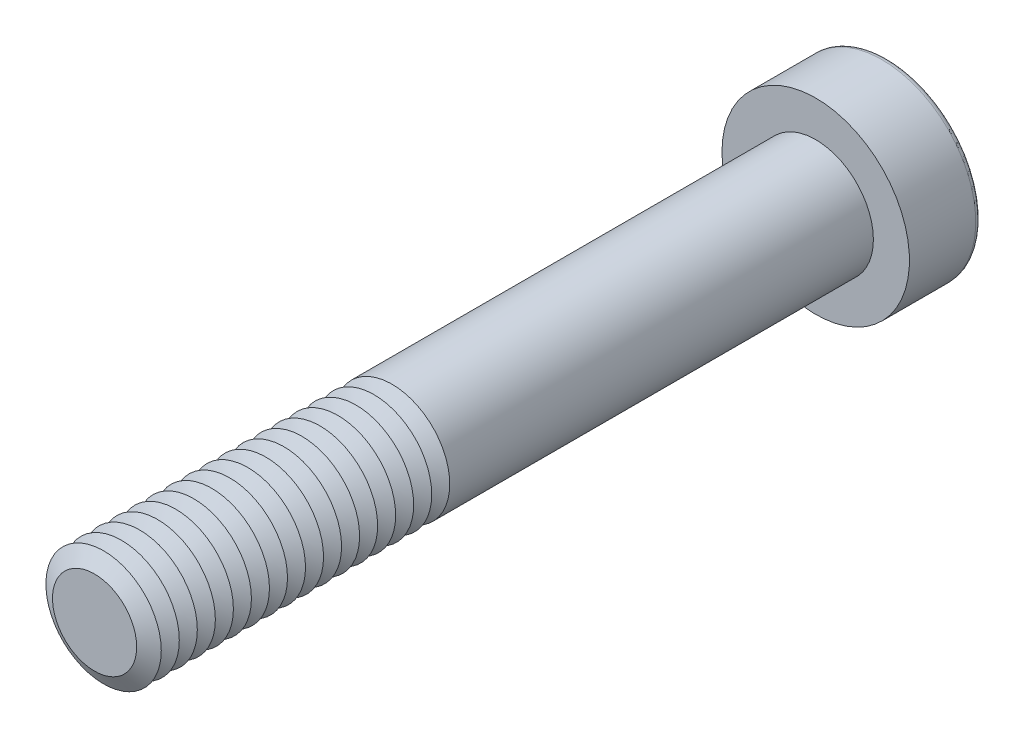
ISO-10303-21;
HEADER;
FILE_DESCRIPTION(('STEP AP214'),'2;1');
FILE_NAME('part.step','',(''),(''),'','','');
FILE_SCHEMA(('AUTOMOTIVE_DESIGN { 1 0 10303 214 1 1 1 1 }'));
ENDSEC;
DATA;
#1=APPLICATION_CONTEXT('core data for automotive mechanical design processes');
#2=APPLICATION_PROTOCOL_DEFINITION('international standard','automotive_design',2000,#1);
#3=PRODUCT_CONTEXT('',#1,'mechanical');
#4=PRODUCT('Part','Part','',(#3));
#5=PRODUCT_RELATED_PRODUCT_CATEGORY('part','',(#4));
#6=PRODUCT_DEFINITION_FORMATION('','',#4);
#7=PRODUCT_DEFINITION_CONTEXT('part definition',#1,'design');
#8=PRODUCT_DEFINITION('design','',#6,#7);
#9=PRODUCT_DEFINITION_SHAPE('','',#8);
#10=(LENGTH_UNIT() NAMED_UNIT(*) SI_UNIT(.MILLI.,.METRE.));
#11=(NAMED_UNIT(*) PLANE_ANGLE_UNIT() SI_UNIT($,.RADIAN.));
#12=(NAMED_UNIT(*) SI_UNIT($,.STERADIAN.) SOLID_ANGLE_UNIT());
#13=UNCERTAINTY_MEASURE_WITH_UNIT(LENGTH_MEASURE(1.E-05),#10,'distance_accuracy_value','');
#14=(GEOMETRIC_REPRESENTATION_CONTEXT(3) GLOBAL_UNCERTAINTY_ASSIGNED_CONTEXT((#13)) GLOBAL_UNIT_ASSIGNED_CONTEXT((#10,
#11,#12)) REPRESENTATION_CONTEXT('',''));
#15=CARTESIAN_POINT('',(0.,0.,0.));
#16=DIRECTION('',(0.,0.,1.));
#17=DIRECTION('',(1.,0.,0.));
#18=AXIS2_PLACEMENT_3D('',#15,#16,#17);
#19=CARTESIAN_POINT('',(0.,0.,45.625));
#20=DIRECTION('',(0.,0.,1.));
#21=DIRECTION('',(1.,0.,0.));
#22=AXIS2_PLACEMENT_3D('',#19,#20,#21);
#23=CONICAL_SURFACE('',#22,4.,1.0471975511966);
#24=CARTESIAN_POINT('',(0.,0.,45.));
#25=DIRECTION('',(0.,0.,1.));
#26=DIRECTION('',(1.,0.,0.));
#27=AXIS2_PLACEMENT_3D('',#24,#25,#26);
#28=CIRCLE('',#27,2.91746824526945);
#29=CARTESIAN_POINT('',(2.91746824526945,0.,45.));
#30=VERTEX_POINT('',#29);
#31=EDGE_CURVE('E313',#30,#30,#28,.T.);
#32=ORIENTED_EDGE('',*,*,#31,.T.);
#33=EDGE_LOOP('',(#32));
#34=FACE_BOUND('',#33,.T.);
#35=CARTESIAN_POINT('',(0.,0.,45.625));
#36=DIRECTION('',(0.,0.,1.));
#37=DIRECTION('',(1.,0.,0.));
#38=AXIS2_PLACEMENT_3D('',#35,#36,#37);
#39=CIRCLE('',#38,4.);
#40=CARTESIAN_POINT('',(4.,0.,45.625));
#41=VERTEX_POINT('',#40);
#42=EDGE_CURVE('E316',#41,#41,#39,.T.);
#43=ORIENTED_EDGE('',*,*,#42,.F.);
#44=EDGE_LOOP('',(#43));
#45=FACE_BOUND('',#44,.T.);
#46=ADVANCED_FACE('F39',(#34,#45),#23,.T.);
#47=CARTESIAN_POINT('',(0.,0.,45.));
#48=DIRECTION('',(0.,0.,-1.));
#49=DIRECTION('',(-1.,0.,0.));
#50=AXIS2_PLACEMENT_3D('',#47,#48,#49);
#51=CONICAL_SURFACE('',#50,2.91746824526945,1.0471975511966);
#52=CARTESIAN_POINT('',(0.,0.,44.375));
#53=DIRECTION('',(0.,0.,1.));
#54=DIRECTION('',(1.,0.,0.));
#55=AXIS2_PLACEMENT_3D('',#52,#53,#54);
#56=CIRCLE('',#55,4.);
#57=CARTESIAN_POINT('',(4.,0.,44.375));
#58=VERTEX_POINT('',#57);
#59=EDGE_CURVE('E323',#58,#58,#56,.T.);
#60=ORIENTED_EDGE('',*,*,#59,.T.);
#61=EDGE_LOOP('',(#60));
#62=FACE_BOUND('',#61,.T.);
#63=ORIENTED_EDGE('',*,*,#31,.F.);
#64=EDGE_LOOP('',(#63));
#65=FACE_BOUND('',#64,.T.);
#66=ADVANCED_FACE('F245',(#62,#65),#51,.T.);
#67=CARTESIAN_POINT('',(0.,0.,50.));
#68=DIRECTION('',(0.,0.,1.));
#69=DIRECTION('',(1.,0.,0.));
#70=AXIS2_PLACEMENT_3D('',#67,#68,#69);
#71=PLANE('',#70);
#72=CARTESIAN_POINT('',(0.,0.,50.));
#73=DIRECTION('',(0.,0.,1.));
#74=DIRECTION('',(1.,0.,0.));
#75=AXIS2_PLACEMENT_3D('',#72,#73,#74);
#76=CIRCLE('',#75,2.91746824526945);
#77=CARTESIAN_POINT('',(2.91746824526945,0.,50.));
#78=VERTEX_POINT('',#77);
#79=EDGE_CURVE('E174',#78,#78,#76,.T.);
#80=ORIENTED_EDGE('',*,*,#79,.T.);
#81=EDGE_LOOP('',(#80));
#82=FACE_BOUND('',#81,.T.);
#83=ADVANCED_FACE('F251',(#82),#71,.T.);
#84=CARTESIAN_POINT('',(0.,0.,50.));
#85=DIRECTION('',(0.,0.,-1.));
#86=DIRECTION('',(-1.,0.,0.));
#87=AXIS2_PLACEMENT_3D('',#84,#85,#86);
#88=CONICAL_SURFACE('',#87,2.91746824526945,1.0471975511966);
#89=CARTESIAN_POINT('',(0.,0.,49.375));
#90=DIRECTION('',(0.,0.,1.));
#91=DIRECTION('',(1.,0.,0.));
#92=AXIS2_PLACEMENT_3D('',#89,#90,#91);
#93=CIRCLE('',#92,4.);
#94=CARTESIAN_POINT('',(4.,0.,49.375));
#95=VERTEX_POINT('',#94);
#96=EDGE_CURVE('E291',#95,#95,#93,.T.);
#97=ORIENTED_EDGE('',*,*,#96,.T.);
#98=EDGE_LOOP('',(#97));
#99=FACE_BOUND('',#98,.T.);
#100=ORIENTED_EDGE('',*,*,#79,.F.);
#101=EDGE_LOOP('',(#100));
#102=FACE_BOUND('',#101,.T.);
#103=ADVANCED_FACE('F199',(#99,#102),#88,.T.);
#104=CARTESIAN_POINT('',(0.,0.,49.375));
#105=DIRECTION('',(0.,0.,1.));
#106=DIRECTION('',(1.,0.,0.));
#107=AXIS2_PLACEMENT_3D('',#104,#105,#106);
#108=CONICAL_SURFACE('',#107,4.,1.0471975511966);
#109=CARTESIAN_POINT('',(0.,0.,48.75));
#110=DIRECTION('',(0.,0.,1.));
#111=DIRECTION('',(1.,0.,0.));
#112=AXIS2_PLACEMENT_3D('',#109,#110,#111);
#113=CIRCLE('',#112,2.91746824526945);
#114=CARTESIAN_POINT('',(2.91746824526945,0.,48.75));
#115=VERTEX_POINT('',#114);
#116=EDGE_CURVE('E288',#115,#115,#113,.T.);
#117=ORIENTED_EDGE('',*,*,#116,.T.);
#118=EDGE_LOOP('',(#117));
#119=FACE_BOUND('',#118,.T.);
#120=ORIENTED_EDGE('',*,*,#96,.F.);
#121=EDGE_LOOP('',(#120));
#122=FACE_BOUND('',#121,.T.);
#123=ADVANCED_FACE('F277',(#119,#122),#108,.T.);
#124=CARTESIAN_POINT('',(0.,0.,48.75));
#125=DIRECTION('',(0.,0.,-1.));
#126=DIRECTION('',(-1.,0.,0.));
#127=AXIS2_PLACEMENT_3D('',#124,#125,#126);
#128=CONICAL_SURFACE('',#127,2.91746824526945,1.0471975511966);
#129=CARTESIAN_POINT('',(0.,0.,48.125));
#130=DIRECTION('',(0.,0.,1.));
#131=DIRECTION('',(1.,0.,0.));
#132=AXIS2_PLACEMENT_3D('',#129,#130,#131);
#133=CIRCLE('',#132,4.);
#134=CARTESIAN_POINT('',(4.,0.,48.125));
#135=VERTEX_POINT('',#134);
#136=EDGE_CURVE('E299',#135,#135,#133,.T.);
#137=ORIENTED_EDGE('',*,*,#136,.T.);
#138=EDGE_LOOP('',(#137));
#139=FACE_BOUND('',#138,.T.);
#140=ORIENTED_EDGE('',*,*,#116,.F.);
#141=EDGE_LOOP('',(#140));
#142=FACE_BOUND('',#141,.T.);
#143=ADVANCED_FACE('F274',(#139,#142),#128,.T.);
#144=CARTESIAN_POINT('',(0.,0.,48.125));
#145=DIRECTION('',(0.,0.,1.));
#146=DIRECTION('',(1.,0.,0.));
#147=AXIS2_PLACEMENT_3D('',#144,#145,#146);
#148=CONICAL_SURFACE('',#147,4.,1.0471975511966);
#149=CARTESIAN_POINT('',(0.,0.,47.5));
#150=DIRECTION('',(0.,0.,1.));
#151=DIRECTION('',(1.,0.,0.));
#152=AXIS2_PLACEMENT_3D('',#149,#150,#151);
#153=CIRCLE('',#152,2.91746824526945);
#154=CARTESIAN_POINT('',(2.91746824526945,0.,47.5));
#155=VERTEX_POINT('',#154);
#156=EDGE_CURVE('E293',#155,#155,#153,.T.);
#157=ORIENTED_EDGE('',*,*,#156,.T.);
#158=EDGE_LOOP('',(#157));
#159=FACE_BOUND('',#158,.T.);
#160=ORIENTED_EDGE('',*,*,#136,.F.);
#161=EDGE_LOOP('',(#160));
#162=FACE_BOUND('',#161,.T.);
#163=ADVANCED_FACE('F270',(#159,#162),#148,.T.);
#164=CARTESIAN_POINT('',(0.,0.,47.5));
#165=DIRECTION('',(0.,0.,-1.));
#166=DIRECTION('',(-1.,0.,0.));
#167=AXIS2_PLACEMENT_3D('',#164,#165,#166);
#168=CONICAL_SURFACE('',#167,2.91746824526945,1.0471975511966);
#169=CARTESIAN_POINT('',(0.,0.,46.875));
#170=DIRECTION('',(0.,0.,1.));
#171=DIRECTION('',(1.,0.,0.));
#172=AXIS2_PLACEMENT_3D('',#169,#170,#171);
#173=CIRCLE('',#172,4.);
#174=CARTESIAN_POINT('',(4.,0.,46.875));
#175=VERTEX_POINT('',#174);
#176=EDGE_CURVE('E309',#175,#175,#173,.T.);
#177=ORIENTED_EDGE('',*,*,#176,.T.);
#178=EDGE_LOOP('',(#177));
#179=FACE_BOUND('',#178,.T.);
#180=ORIENTED_EDGE('',*,*,#156,.F.);
#181=EDGE_LOOP('',(#180));
#182=FACE_BOUND('',#181,.T.);
#183=ADVANCED_FACE('F266',(#179,#182),#168,.T.);
#184=CARTESIAN_POINT('',(0.,0.,46.875));
#185=DIRECTION('',(0.,0.,1.));
#186=DIRECTION('',(1.,0.,0.));
#187=AXIS2_PLACEMENT_3D('',#184,#185,#186);
#188=CONICAL_SURFACE('',#187,4.,1.0471975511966);
#189=CARTESIAN_POINT('',(0.,0.,46.25));
#190=DIRECTION('',(0.,0.,1.));
#191=DIRECTION('',(1.,0.,0.));
#192=AXIS2_PLACEMENT_3D('',#189,#190,#191);
#193=CIRCLE('',#192,2.91746824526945);
#194=CARTESIAN_POINT('',(2.91746824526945,0.,46.25));
#195=VERTEX_POINT('',#194);
#196=EDGE_CURVE('E305',#195,#195,#193,.T.);
#197=ORIENTED_EDGE('',*,*,#196,.T.);
#198=EDGE_LOOP('',(#197));
#199=FACE_BOUND('',#198,.T.);
#200=ORIENTED_EDGE('',*,*,#176,.F.);
#201=EDGE_LOOP('',(#200));
#202=FACE_BOUND('',#201,.T.);
#203=ADVANCED_FACE('F262',(#199,#202),#188,.T.);
#204=CARTESIAN_POINT('',(0.,0.,46.25));
#205=DIRECTION('',(0.,0.,-1.));
#206=DIRECTION('',(-1.,0.,0.));
#207=AXIS2_PLACEMENT_3D('',#204,#205,#206);
#208=CONICAL_SURFACE('',#207,2.91746824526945,1.0471975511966);
#209=ORIENTED_EDGE('',*,*,#42,.T.);
#210=EDGE_LOOP('',(#209));
#211=FACE_BOUND('',#210,.T.);
#212=ORIENTED_EDGE('',*,*,#196,.F.);
#213=EDGE_LOOP('',(#212));
#214=FACE_BOUND('',#213,.T.);
#215=ADVANCED_FACE('F258',(#211,#214),#208,.T.);
#216=CARTESIAN_POINT('',(0.,0.,44.375));
#217=DIRECTION('',(0.,0.,1.));
#218=DIRECTION('',(1.,0.,0.));
#219=AXIS2_PLACEMENT_3D('',#216,#217,#218);
#220=CONICAL_SURFACE('',#219,4.,1.0471975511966);
#221=CARTESIAN_POINT('',(0.,0.,43.75));
#222=DIRECTION('',(0.,0.,1.));
#223=DIRECTION('',(1.,0.,0.));
#224=AXIS2_PLACEMENT_3D('',#221,#222,#223);
#225=CIRCLE('',#224,2.91746824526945);
#226=CARTESIAN_POINT('',(2.91746824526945,0.,43.75));
#227=VERTEX_POINT('',#226);
#228=EDGE_CURVE('E319',#227,#227,#225,.T.);
#229=ORIENTED_EDGE('',*,*,#228,.T.);
#230=EDGE_LOOP('',(#229));
#231=FACE_BOUND('',#230,.T.);
#232=ORIENTED_EDGE('',*,*,#59,.F.);
#233=EDGE_LOOP('',(#232));
#234=FACE_BOUND('',#233,.T.);
#235=ADVANCED_FACE('F261',(#231,#234),#220,.T.);
#236=CARTESIAN_POINT('',(0.,0.,43.75));
#237=DIRECTION('',(0.,0.,-1.));
#238=DIRECTION('',(-1.,0.,0.));
#239=AXIS2_PLACEMENT_3D('',#236,#237,#238);
#240=CONICAL_SURFACE('',#239,2.91746824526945,1.0471975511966);
#241=CARTESIAN_POINT('',(0.,0.,43.125));
#242=DIRECTION('',(0.,0.,1.));
#243=DIRECTION('',(1.,0.,0.));
#244=AXIS2_PLACEMENT_3D('',#241,#242,#243);
#245=CIRCLE('',#244,4.);
#246=CARTESIAN_POINT('',(4.,0.,43.125));
#247=VERTEX_POINT('',#246);
#248=EDGE_CURVE('E331',#247,#247,#245,.T.);
#249=ORIENTED_EDGE('',*,*,#248,.T.);
#250=EDGE_LOOP('',(#249));
#251=FACE_BOUND('',#250,.T.);
#252=ORIENTED_EDGE('',*,*,#228,.F.);
#253=EDGE_LOOP('',(#252));
#254=FACE_BOUND('',#253,.T.);
#255=ADVANCED_FACE('F511',(#251,#254),#240,.T.);
#256=CARTESIAN_POINT('',(0.,0.,43.125));
#257=DIRECTION('',(0.,0.,1.));
#258=DIRECTION('',(1.,0.,0.));
#259=AXIS2_PLACEMENT_3D('',#256,#257,#258);
#260=CONICAL_SURFACE('',#259,4.,1.0471975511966);
#261=CARTESIAN_POINT('',(0.,0.,42.5));
#262=DIRECTION('',(0.,0.,1.));
#263=DIRECTION('',(1.,0.,0.));
#264=AXIS2_PLACEMENT_3D('',#261,#262,#263);
#265=CIRCLE('',#264,2.91746824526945);
#266=CARTESIAN_POINT('',(2.91746824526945,0.,42.5));
#267=VERTEX_POINT('',#266);
#268=EDGE_CURVE('E327',#267,#267,#265,.T.);
#269=ORIENTED_EDGE('',*,*,#268,.T.);
#270=EDGE_LOOP('',(#269));
#271=FACE_BOUND('',#270,.T.);
#272=ORIENTED_EDGE('',*,*,#248,.F.);
#273=EDGE_LOOP('',(#272));
#274=FACE_BOUND('',#273,.T.);
#275=ADVANCED_FACE('F507',(#271,#274),#260,.T.);
#276=CARTESIAN_POINT('',(0.,0.,42.5));
#277=DIRECTION('',(0.,0.,-1.));
#278=DIRECTION('',(-1.,0.,0.));
#279=AXIS2_PLACEMENT_3D('',#276,#277,#278);
#280=CONICAL_SURFACE('',#279,2.91746824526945,1.0471975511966);
#281=CARTESIAN_POINT('',(0.,0.,41.875));
#282=DIRECTION('',(0.,0.,1.));
#283=DIRECTION('',(1.,0.,0.));
#284=AXIS2_PLACEMENT_3D('',#281,#282,#283);
#285=CIRCLE('',#284,4.);
#286=CARTESIAN_POINT('',(4.,0.,41.875));
#287=VERTEX_POINT('',#286);
#288=EDGE_CURVE('E339',#287,#287,#285,.T.);
#289=ORIENTED_EDGE('',*,*,#288,.T.);
#290=EDGE_LOOP('',(#289));
#291=FACE_BOUND('',#290,.T.);
#292=ORIENTED_EDGE('',*,*,#268,.F.);
#293=EDGE_LOOP('',(#292));
#294=FACE_BOUND('',#293,.T.);
#295=ADVANCED_FACE('F503',(#291,#294),#280,.T.);
#296=CARTESIAN_POINT('',(0.,0.,41.875));
#297=DIRECTION('',(0.,0.,1.));
#298=DIRECTION('',(1.,0.,0.));
#299=AXIS2_PLACEMENT_3D('',#296,#297,#298);
#300=CONICAL_SURFACE('',#299,4.,1.0471975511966);
#301=CARTESIAN_POINT('',(0.,0.,41.25));
#302=DIRECTION('',(0.,0.,1.));
#303=DIRECTION('',(1.,0.,0.));
#304=AXIS2_PLACEMENT_3D('',#301,#302,#303);
#305=CIRCLE('',#304,2.91746824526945);
#306=CARTESIAN_POINT('',(2.91746824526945,0.,41.25));
#307=VERTEX_POINT('',#306);
#308=EDGE_CURVE('E335',#307,#307,#305,.T.);
#309=ORIENTED_EDGE('',*,*,#308,.T.);
#310=EDGE_LOOP('',(#309));
#311=FACE_BOUND('',#310,.T.);
#312=ORIENTED_EDGE('',*,*,#288,.F.);
#313=EDGE_LOOP('',(#312));
#314=FACE_BOUND('',#313,.T.);
#315=ADVANCED_FACE('F499',(#311,#314),#300,.T.);
#316=CARTESIAN_POINT('',(0.,0.,41.25));
#317=DIRECTION('',(0.,0.,-1.));
#318=DIRECTION('',(-1.,0.,0.));
#319=AXIS2_PLACEMENT_3D('',#316,#317,#318);
#320=CONICAL_SURFACE('',#319,2.91746824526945,1.0471975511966);
#321=CARTESIAN_POINT('',(0.,0.,40.625));
#322=DIRECTION('',(0.,0.,1.));
#323=DIRECTION('',(1.,0.,0.));
#324=AXIS2_PLACEMENT_3D('',#321,#322,#323);
#325=CIRCLE('',#324,4.);
#326=CARTESIAN_POINT('',(4.,0.,40.625));
#327=VERTEX_POINT('',#326);
#328=EDGE_CURVE('E347',#327,#327,#325,.T.);
#329=ORIENTED_EDGE('',*,*,#328,.T.);
#330=EDGE_LOOP('',(#329));
#331=FACE_BOUND('',#330,.T.);
#332=ORIENTED_EDGE('',*,*,#308,.F.);
#333=EDGE_LOOP('',(#332));
#334=FACE_BOUND('',#333,.T.);
#335=ADVANCED_FACE('F495',(#331,#334),#320,.T.);
#336=CARTESIAN_POINT('',(0.,0.,40.625));
#337=DIRECTION('',(0.,0.,1.));
#338=DIRECTION('',(1.,0.,0.));
#339=AXIS2_PLACEMENT_3D('',#336,#337,#338);
#340=CONICAL_SURFACE('',#339,4.,1.0471975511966);
#341=CARTESIAN_POINT('',(0.,0.,40.));
#342=DIRECTION('',(0.,0.,1.));
#343=DIRECTION('',(1.,0.,0.));
#344=AXIS2_PLACEMENT_3D('',#341,#342,#343);
#345=CIRCLE('',#344,2.91746824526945);
#346=CARTESIAN_POINT('',(2.91746824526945,0.,40.));
#347=VERTEX_POINT('',#346);
#348=EDGE_CURVE('E343',#347,#347,#345,.T.);
#349=ORIENTED_EDGE('',*,*,#348,.T.);
#350=EDGE_LOOP('',(#349));
#351=FACE_BOUND('',#350,.T.);
#352=ORIENTED_EDGE('',*,*,#328,.F.);
#353=EDGE_LOOP('',(#352));
#354=FACE_BOUND('',#353,.T.);
#355=ADVANCED_FACE('F491',(#351,#354),#340,.T.);
#356=CARTESIAN_POINT('',(0.,0.,40.));
#357=DIRECTION('',(0.,0.,-1.));
#358=DIRECTION('',(-1.,0.,0.));
#359=AXIS2_PLACEMENT_3D('',#356,#357,#358);
#360=CONICAL_SURFACE('',#359,2.91746824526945,1.0471975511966);
#361=CARTESIAN_POINT('',(0.,0.,39.375));
#362=DIRECTION('',(0.,0.,1.));
#363=DIRECTION('',(1.,0.,0.));
#364=AXIS2_PLACEMENT_3D('',#361,#362,#363);
#365=CIRCLE('',#364,4.);
#366=CARTESIAN_POINT('',(4.,0.,39.375));
#367=VERTEX_POINT('',#366);
#368=EDGE_CURVE('E355',#367,#367,#365,.T.);
#369=ORIENTED_EDGE('',*,*,#368,.T.);
#370=EDGE_LOOP('',(#369));
#371=FACE_BOUND('',#370,.T.);
#372=ORIENTED_EDGE('',*,*,#348,.F.);
#373=EDGE_LOOP('',(#372));
#374=FACE_BOUND('',#373,.T.);
#375=ADVANCED_FACE('F487',(#371,#374),#360,.T.);
#376=CARTESIAN_POINT('',(0.,0.,39.375));
#377=DIRECTION('',(0.,0.,1.));
#378=DIRECTION('',(1.,0.,0.));
#379=AXIS2_PLACEMENT_3D('',#376,#377,#378);
#380=CONICAL_SURFACE('',#379,4.,1.0471975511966);
#381=CARTESIAN_POINT('',(0.,0.,38.75));
#382=DIRECTION('',(0.,0.,1.));
#383=DIRECTION('',(1.,0.,0.));
#384=AXIS2_PLACEMENT_3D('',#381,#382,#383);
#385=CIRCLE('',#384,2.91746824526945);
#386=CARTESIAN_POINT('',(2.91746824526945,0.,38.75));
#387=VERTEX_POINT('',#386);
#388=EDGE_CURVE('E351',#387,#387,#385,.T.);
#389=ORIENTED_EDGE('',*,*,#388,.T.);
#390=EDGE_LOOP('',(#389));
#391=FACE_BOUND('',#390,.T.);
#392=ORIENTED_EDGE('',*,*,#368,.F.);
#393=EDGE_LOOP('',(#392));
#394=FACE_BOUND('',#393,.T.);
#395=ADVANCED_FACE('F483',(#391,#394),#380,.T.);
#396=CARTESIAN_POINT('',(0.,0.,38.75));
#397=DIRECTION('',(0.,0.,-1.));
#398=DIRECTION('',(-1.,0.,0.));
#399=AXIS2_PLACEMENT_3D('',#396,#397,#398);
#400=CONICAL_SURFACE('',#399,2.91746824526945,1.0471975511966);
#401=CARTESIAN_POINT('',(0.,0.,38.125));
#402=DIRECTION('',(0.,0.,1.));
#403=DIRECTION('',(1.,0.,0.));
#404=AXIS2_PLACEMENT_3D('',#401,#402,#403);
#405=CIRCLE('',#404,4.);
#406=CARTESIAN_POINT('',(4.,0.,38.125));
#407=VERTEX_POINT('',#406);
#408=EDGE_CURVE('E363',#407,#407,#405,.T.);
#409=ORIENTED_EDGE('',*,*,#408,.T.);
#410=EDGE_LOOP('',(#409));
#411=FACE_BOUND('',#410,.T.);
#412=ORIENTED_EDGE('',*,*,#388,.F.);
#413=EDGE_LOOP('',(#412));
#414=FACE_BOUND('',#413,.T.);
#415=ADVANCED_FACE('F479',(#411,#414),#400,.T.);
#416=CARTESIAN_POINT('',(0.,0.,38.125));
#417=DIRECTION('',(0.,0.,1.));
#418=DIRECTION('',(1.,0.,0.));
#419=AXIS2_PLACEMENT_3D('',#416,#417,#418);
#420=CONICAL_SURFACE('',#419,4.,1.0471975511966);
#421=CARTESIAN_POINT('',(0.,0.,37.5));
#422=DIRECTION('',(0.,0.,1.));
#423=DIRECTION('',(1.,0.,0.));
#424=AXIS2_PLACEMENT_3D('',#421,#422,#423);
#425=CIRCLE('',#424,2.91746824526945);
#426=CARTESIAN_POINT('',(2.91746824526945,0.,37.5));
#427=VERTEX_POINT('',#426);
#428=EDGE_CURVE('E359',#427,#427,#425,.T.);
#429=ORIENTED_EDGE('',*,*,#428,.T.);
#430=EDGE_LOOP('',(#429));
#431=FACE_BOUND('',#430,.T.);
#432=ORIENTED_EDGE('',*,*,#408,.F.);
#433=EDGE_LOOP('',(#432));
#434=FACE_BOUND('',#433,.T.);
#435=ADVANCED_FACE('F475',(#431,#434),#420,.T.);
#436=CARTESIAN_POINT('',(0.,0.,37.5));
#437=DIRECTION('',(0.,0.,-1.));
#438=DIRECTION('',(-1.,0.,0.));
#439=AXIS2_PLACEMENT_3D('',#436,#437,#438);
#440=CONICAL_SURFACE('',#439,2.91746824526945,1.0471975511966);
#441=CARTESIAN_POINT('',(0.,0.,36.875));
#442=DIRECTION('',(0.,0.,1.));
#443=DIRECTION('',(1.,0.,0.));
#444=AXIS2_PLACEMENT_3D('',#441,#442,#443);
#445=CIRCLE('',#444,4.);
#446=CARTESIAN_POINT('',(4.,0.,36.875));
#447=VERTEX_POINT('',#446);
#448=EDGE_CURVE('E371',#447,#447,#445,.T.);
#449=ORIENTED_EDGE('',*,*,#448,.T.);
#450=EDGE_LOOP('',(#449));
#451=FACE_BOUND('',#450,.T.);
#452=ORIENTED_EDGE('',*,*,#428,.F.);
#453=EDGE_LOOP('',(#452));
#454=FACE_BOUND('',#453,.T.);
#455=ADVANCED_FACE('F471',(#451,#454),#440,.T.);
#456=CARTESIAN_POINT('',(0.,0.,36.875));
#457=DIRECTION('',(0.,0.,1.));
#458=DIRECTION('',(1.,0.,0.));
#459=AXIS2_PLACEMENT_3D('',#456,#457,#458);
#460=CONICAL_SURFACE('',#459,4.,1.0471975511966);
#461=CARTESIAN_POINT('',(0.,0.,36.25));
#462=DIRECTION('',(0.,0.,1.));
#463=DIRECTION('',(1.,0.,0.));
#464=AXIS2_PLACEMENT_3D('',#461,#462,#463);
#465=CIRCLE('',#464,2.91746824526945);
#466=CARTESIAN_POINT('',(2.91746824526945,0.,36.25));
#467=VERTEX_POINT('',#466);
#468=EDGE_CURVE('E367',#467,#467,#465,.T.);
#469=ORIENTED_EDGE('',*,*,#468,.T.);
#470=EDGE_LOOP('',(#469));
#471=FACE_BOUND('',#470,.T.);
#472=ORIENTED_EDGE('',*,*,#448,.F.);
#473=EDGE_LOOP('',(#472));
#474=FACE_BOUND('',#473,.T.);
#475=ADVANCED_FACE('F467',(#471,#474),#460,.T.);
#476=CARTESIAN_POINT('',(0.,0.,36.25));
#477=DIRECTION('',(0.,0.,-1.));
#478=DIRECTION('',(-1.,0.,0.));
#479=AXIS2_PLACEMENT_3D('',#476,#477,#478);
#480=CONICAL_SURFACE('',#479,2.91746824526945,1.0471975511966);
#481=CARTESIAN_POINT('',(0.,0.,35.625));
#482=DIRECTION('',(0.,0.,1.));
#483=DIRECTION('',(1.,0.,0.));
#484=AXIS2_PLACEMENT_3D('',#481,#482,#483);
#485=CIRCLE('',#484,4.);
#486=CARTESIAN_POINT('',(4.,0.,35.625));
#487=VERTEX_POINT('',#486);
#488=EDGE_CURVE('E379',#487,#487,#485,.T.);
#489=ORIENTED_EDGE('',*,*,#488,.T.);
#490=EDGE_LOOP('',(#489));
#491=FACE_BOUND('',#490,.T.);
#492=ORIENTED_EDGE('',*,*,#468,.F.);
#493=EDGE_LOOP('',(#492));
#494=FACE_BOUND('',#493,.T.);
#495=ADVANCED_FACE('F463',(#491,#494),#480,.T.);
#496=CARTESIAN_POINT('',(0.,0.,35.625));
#497=DIRECTION('',(0.,0.,1.));
#498=DIRECTION('',(1.,0.,0.));
#499=AXIS2_PLACEMENT_3D('',#496,#497,#498);
#500=CONICAL_SURFACE('',#499,4.,1.0471975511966);
#501=CARTESIAN_POINT('',(0.,0.,35.));
#502=DIRECTION('',(0.,0.,1.));
#503=DIRECTION('',(1.,0.,0.));
#504=AXIS2_PLACEMENT_3D('',#501,#502,#503);
#505=CIRCLE('',#504,2.91746824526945);
#506=CARTESIAN_POINT('',(2.91746824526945,0.,35.));
#507=VERTEX_POINT('',#506);
#508=EDGE_CURVE('E375',#507,#507,#505,.T.);
#509=ORIENTED_EDGE('',*,*,#508,.T.);
#510=EDGE_LOOP('',(#509));
#511=FACE_BOUND('',#510,.T.);
#512=ORIENTED_EDGE('',*,*,#488,.F.);
#513=EDGE_LOOP('',(#512));
#514=FACE_BOUND('',#513,.T.);
#515=ADVANCED_FACE('F459',(#511,#514),#500,.T.);
#516=CARTESIAN_POINT('',(0.,0.,35.));
#517=DIRECTION('',(0.,0.,-1.));
#518=DIRECTION('',(-1.,0.,0.));
#519=AXIS2_PLACEMENT_3D('',#516,#517,#518);
#520=CONICAL_SURFACE('',#519,2.91746824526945,1.0471975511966);
#521=CARTESIAN_POINT('',(0.,0.,34.375));
#522=DIRECTION('',(0.,0.,1.));
#523=DIRECTION('',(1.,0.,0.));
#524=AXIS2_PLACEMENT_3D('',#521,#522,#523);
#525=CIRCLE('',#524,4.);
#526=CARTESIAN_POINT('',(4.,0.,34.375));
#527=VERTEX_POINT('',#526);
#528=EDGE_CURVE('E387',#527,#527,#525,.T.);
#529=ORIENTED_EDGE('',*,*,#528,.T.);
#530=EDGE_LOOP('',(#529));
#531=FACE_BOUND('',#530,.T.);
#532=ORIENTED_EDGE('',*,*,#508,.F.);
#533=EDGE_LOOP('',(#532));
#534=FACE_BOUND('',#533,.T.);
#535=ADVANCED_FACE('F455',(#531,#534),#520,.T.);
#536=CARTESIAN_POINT('',(0.,0.,34.375));
#537=DIRECTION('',(0.,0.,1.));
#538=DIRECTION('',(1.,0.,0.));
#539=AXIS2_PLACEMENT_3D('',#536,#537,#538);
#540=CONICAL_SURFACE('',#539,4.,1.0471975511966);
#541=CARTESIAN_POINT('',(0.,0.,33.75));
#542=DIRECTION('',(0.,0.,1.));
#543=DIRECTION('',(1.,0.,0.));
#544=AXIS2_PLACEMENT_3D('',#541,#542,#543);
#545=CIRCLE('',#544,2.91746824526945);
#546=CARTESIAN_POINT('',(2.91746824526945,0.,33.75));
#547=VERTEX_POINT('',#546);
#548=EDGE_CURVE('E383',#547,#547,#545,.T.);
#549=ORIENTED_EDGE('',*,*,#548,.T.);
#550=EDGE_LOOP('',(#549));
#551=FACE_BOUND('',#550,.T.);
#552=ORIENTED_EDGE('',*,*,#528,.F.);
#553=EDGE_LOOP('',(#552));
#554=FACE_BOUND('',#553,.T.);
#555=ADVANCED_FACE('F451',(#551,#554),#540,.T.);
#556=CARTESIAN_POINT('',(0.,0.,33.75));
#557=DIRECTION('',(0.,0.,-1.));
#558=DIRECTION('',(-1.,0.,0.));
#559=AXIS2_PLACEMENT_3D('',#556,#557,#558);
#560=CONICAL_SURFACE('',#559,2.91746824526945,1.0471975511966);
#561=CARTESIAN_POINT('',(0.,0.,33.125));
#562=DIRECTION('',(0.,0.,1.));
#563=DIRECTION('',(1.,0.,0.));
#564=AXIS2_PLACEMENT_3D('',#561,#562,#563);
#565=CIRCLE('',#564,4.);
#566=CARTESIAN_POINT('',(4.,0.,33.125));
#567=VERTEX_POINT('',#566);
#568=EDGE_CURVE('E395',#567,#567,#565,.T.);
#569=ORIENTED_EDGE('',*,*,#568,.T.);
#570=EDGE_LOOP('',(#569));
#571=FACE_BOUND('',#570,.T.);
#572=ORIENTED_EDGE('',*,*,#548,.F.);
#573=EDGE_LOOP('',(#572));
#574=FACE_BOUND('',#573,.T.);
#575=ADVANCED_FACE('F447',(#571,#574),#560,.T.);
#576=CARTESIAN_POINT('',(0.,0.,33.125));
#577=DIRECTION('',(0.,0.,1.));
#578=DIRECTION('',(1.,0.,0.));
#579=AXIS2_PLACEMENT_3D('',#576,#577,#578);
#580=CONICAL_SURFACE('',#579,4.,1.0471975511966);
#581=CARTESIAN_POINT('',(0.,0.,32.5));
#582=DIRECTION('',(0.,0.,1.));
#583=DIRECTION('',(1.,0.,0.));
#584=AXIS2_PLACEMENT_3D('',#581,#582,#583);
#585=CIRCLE('',#584,2.91746824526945);
#586=CARTESIAN_POINT('',(2.91746824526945,0.,32.5));
#587=VERTEX_POINT('',#586);
#588=EDGE_CURVE('E391',#587,#587,#585,.T.);
#589=ORIENTED_EDGE('',*,*,#588,.T.);
#590=EDGE_LOOP('',(#589));
#591=FACE_BOUND('',#590,.T.);
#592=ORIENTED_EDGE('',*,*,#568,.F.);
#593=EDGE_LOOP('',(#592));
#594=FACE_BOUND('',#593,.T.);
#595=ADVANCED_FACE('F443',(#591,#594),#580,.T.);
#596=CARTESIAN_POINT('',(0.,0.,32.5));
#597=DIRECTION('',(0.,0.,-1.));
#598=DIRECTION('',(-1.,0.,0.));
#599=AXIS2_PLACEMENT_3D('',#596,#597,#598);
#600=CONICAL_SURFACE('',#599,2.91746824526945,1.0471975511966);
#601=CARTESIAN_POINT('',(0.,0.,31.875));
#602=DIRECTION('',(0.,0.,1.));
#603=DIRECTION('',(1.,0.,0.));
#604=AXIS2_PLACEMENT_3D('',#601,#602,#603);
#605=CIRCLE('',#604,4.);
#606=CARTESIAN_POINT('',(4.,0.,31.875));
#607=VERTEX_POINT('',#606);
#608=EDGE_CURVE('E403',#607,#607,#605,.T.);
#609=ORIENTED_EDGE('',*,*,#608,.T.);
#610=EDGE_LOOP('',(#609));
#611=FACE_BOUND('',#610,.T.);
#612=ORIENTED_EDGE('',*,*,#588,.F.);
#613=EDGE_LOOP('',(#612));
#614=FACE_BOUND('',#613,.T.);
#615=ADVANCED_FACE('F439',(#611,#614),#600,.T.);
#616=CARTESIAN_POINT('',(0.,0.,31.875));
#617=DIRECTION('',(0.,0.,1.));
#618=DIRECTION('',(1.,0.,0.));
#619=AXIS2_PLACEMENT_3D('',#616,#617,#618);
#620=CONICAL_SURFACE('',#619,4.,1.0471975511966);
#621=CARTESIAN_POINT('',(0.,0.,31.25));
#622=DIRECTION('',(0.,0.,1.));
#623=DIRECTION('',(1.,0.,0.));
#624=AXIS2_PLACEMENT_3D('',#621,#622,#623);
#625=CIRCLE('',#624,2.91746824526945);
#626=CARTESIAN_POINT('',(2.91746824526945,0.,31.25));
#627=VERTEX_POINT('',#626);
#628=EDGE_CURVE('E399',#627,#627,#625,.T.);
#629=ORIENTED_EDGE('',*,*,#628,.T.);
#630=EDGE_LOOP('',(#629));
#631=FACE_BOUND('',#630,.T.);
#632=ORIENTED_EDGE('',*,*,#608,.F.);
#633=EDGE_LOOP('',(#632));
#634=FACE_BOUND('',#633,.T.);
#635=ADVANCED_FACE('F434',(#631,#634),#620,.T.);
#636=CARTESIAN_POINT('',(0.,0.,31.25));
#637=DIRECTION('',(0.,0.,-1.));
#638=DIRECTION('',(-1.,0.,0.));
#639=AXIS2_PLACEMENT_3D('',#636,#637,#638);
#640=CONICAL_SURFACE('',#639,2.91746824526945,1.0471975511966);
#641=CARTESIAN_POINT('',(0.,0.,30.625));
#642=DIRECTION('',(0.,0.,1.));
#643=DIRECTION('',(1.,0.,0.));
#644=AXIS2_PLACEMENT_3D('',#641,#642,#643);
#645=CIRCLE('',#644,4.);
#646=CARTESIAN_POINT('',(4.,0.,30.625));
#647=VERTEX_POINT('',#646);
#648=EDGE_CURVE('E415',#647,#647,#645,.T.);
#649=ORIENTED_EDGE('',*,*,#648,.T.);
#650=EDGE_LOOP('',(#649));
#651=FACE_BOUND('',#650,.T.);
#652=ORIENTED_EDGE('',*,*,#628,.F.);
#653=EDGE_LOOP('',(#652));
#654=FACE_BOUND('',#653,.T.);
#655=ADVANCED_FACE('F420',(#651,#654),#640,.T.);
#656=CARTESIAN_POINT('',(0.,0.,30.625));
#657=DIRECTION('',(0.,0.,1.));
#658=DIRECTION('',(1.,0.,0.));
#659=AXIS2_PLACEMENT_3D('',#656,#657,#658);
#660=CONICAL_SURFACE('',#659,4.,1.0471975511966);
#661=CARTESIAN_POINT('',(0.,0.,30.));
#662=DIRECTION('',(0.,0.,1.));
#663=DIRECTION('',(1.,0.,0.));
#664=AXIS2_PLACEMENT_3D('',#661,#662,#663);
#665=CIRCLE('',#664,2.91746824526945);
#666=CARTESIAN_POINT('',(2.91746824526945,0.,30.));
#667=VERTEX_POINT('',#666);
#668=EDGE_CURVE('E407',#667,#667,#665,.T.);
#669=ORIENTED_EDGE('',*,*,#668,.T.);
#670=EDGE_LOOP('',(#669));
#671=FACE_BOUND('',#670,.T.);
#672=ORIENTED_EDGE('',*,*,#648,.F.);
#673=EDGE_LOOP('',(#672));
#674=FACE_BOUND('',#673,.T.);
#675=ADVANCED_FACE('F423',(#671,#674),#660,.T.);
#676=CARTESIAN_POINT('',(0.,0.,30.));
#677=DIRECTION('',(0.,0.,-1.));
#678=DIRECTION('',(-1.,0.,0.));
#679=AXIS2_PLACEMENT_3D('',#676,#677,#678);
#680=CONICAL_SURFACE('',#679,2.91746824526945,1.0471975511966);
#681=CARTESIAN_POINT('',(0.,0.,29.375));
#682=DIRECTION('',(0.,0.,1.));
#683=DIRECTION('',(1.,0.,0.));
#684=AXIS2_PLACEMENT_3D('',#681,#682,#683);
#685=CIRCLE('',#684,4.);
#686=CARTESIAN_POINT('',(4.,0.,29.375));
#687=VERTEX_POINT('',#686);
#688=EDGE_CURVE('E411',#687,#687,#685,.T.);
#689=ORIENTED_EDGE('',*,*,#688,.T.);
#690=EDGE_LOOP('',(#689));
#691=FACE_BOUND('',#690,.T.);
#692=ORIENTED_EDGE('',*,*,#668,.F.);
#693=EDGE_LOOP('',(#692));
#694=FACE_BOUND('',#693,.T.);
#695=ADVANCED_FACE('F425',(#691,#694),#680,.T.);
#696=CARTESIAN_POINT('',(0.,0.,-1.25));
#697=DIRECTION('',(0.,0.,-1.));
#698=DIRECTION('',(-1.,0.,0.));
#699=AXIS2_PLACEMENT_3D('',#696,#697,#698);
#700=CONICAL_SURFACE('',#699,2.5,1.0471975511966);
#701=CARTESIAN_POINT('',(0.,0.,0.193375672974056));
#702=VERTEX_POINT('',#701);
#703=VERTEX_LOOP('',#702);
#704=FACE_BOUND('',#703,.T.);
#705=CARTESIAN_POINT('',(0.,0.,-1.25));
#706=DIRECTION('',(0.,0.,-1.));
#707=DIRECTION('',(-1.,0.,0.));
#708=AXIS2_PLACEMENT_3D('',#705,#706,#707);
#709=CIRCLE('',#708,2.5);
#710=CARTESIAN_POINT('',(-2.1650635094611,1.25,-1.25));
#711=VERTEX_POINT('',#710);
#712=CARTESIAN_POINT('',(0.,2.5,-1.25));
#713=VERTEX_POINT('',#712);
#714=EDGE_CURVE('E149',#711,#713,#709,.T.);
#715=ORIENTED_EDGE('',*,*,#714,.T.);
#716=CARTESIAN_POINT('',(0.,0.,-1.25));
#717=DIRECTION('',(0.,0.,-1.));
#718=DIRECTION('',(-1.,0.,0.));
#719=AXIS2_PLACEMENT_3D('',#716,#717,#718);
#720=CIRCLE('',#719,2.5);
#721=CARTESIAN_POINT('',(2.1650635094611,1.25,-1.25));
#722=VERTEX_POINT('',#721);
#723=EDGE_CURVE('E54',#713,#722,#720,.T.);
#724=ORIENTED_EDGE('',*,*,#723,.T.);
#725=CARTESIAN_POINT('',(2.1650635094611,-1.25,-1.25));
#726=VERTEX_POINT('',#725);
#727=EDGE_CURVE('E1027',#722,#726,#720,.T.);
#728=ORIENTED_EDGE('',*,*,#727,.T.);
#729=CARTESIAN_POINT('',(0.,-2.5,-1.25));
#730=VERTEX_POINT('',#729);
#731=EDGE_CURVE('E1025',#726,#730,#720,.T.);
#732=ORIENTED_EDGE('',*,*,#731,.T.);
#733=CARTESIAN_POINT('',(-2.1650635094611,-1.25,-1.25));
#734=VERTEX_POINT('',#733);
#735=EDGE_CURVE('E1020',#730,#734,#720,.T.);
#736=ORIENTED_EDGE('',*,*,#735,.T.);
#737=EDGE_CURVE('E1018',#734,#711,#720,.T.);
#738=ORIENTED_EDGE('',*,*,#737,.T.);
#739=EDGE_LOOP('',(#715,#724,#728,#732,#736,#738));
#740=FACE_BOUND('',#739,.T.);
#741=ADVANCED_FACE('F201',(#704,#740),#700,.F.);
#742=CARTESIAN_POINT('',(0.,0.,-1.25));
#743=DIRECTION('',(0.,0.,-1.));
#744=DIRECTION('',(-1.,0.,0.));
#745=AXIS2_PLACEMENT_3D('',#742,#743,#744);
#746=PLANE('',#745);
#747=ORIENTED_EDGE('',*,*,#723,.F.);
#748=DIRECTION('',(1.,0.,0.));
#749=VECTOR('',#748,1.);
#750=CARTESIAN_POINT('',(-1.44337567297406,2.5,-1.25));
#751=LINE('',#750,#749);
#752=CARTESIAN_POINT('',(1.44337567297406,2.5,-1.25));
#753=VERTEX_POINT('',#752);
#754=EDGE_CURVE('E1070',#713,#753,#751,.T.);
#755=ORIENTED_EDGE('',*,*,#754,.T.);
#756=DIRECTION('',(0.5,-0.866025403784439,0.));
#757=VECTOR('',#756,1.);
#758=CARTESIAN_POINT('',(1.44337567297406,2.5,-1.25));
#759=LINE('',#758,#757);
#760=EDGE_CURVE('E155',#753,#722,#759,.T.);
#761=ORIENTED_EDGE('',*,*,#760,.T.);
#762=EDGE_LOOP('',(#747,#755,#761));
#763=FACE_BOUND('',#762,.T.);
#764=ADVANCED_FACE('F606',(#763),#746,.T.);
#765=ORIENTED_EDGE('',*,*,#727,.F.);
#766=CARTESIAN_POINT('',(2.88675134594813,0.,-1.25));
#767=VERTEX_POINT('',#766);
#768=EDGE_CURVE('E1064',#722,#767,#759,.T.);
#769=ORIENTED_EDGE('',*,*,#768,.T.);
#770=DIRECTION('',(-0.5,-0.866025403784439,0.));
#771=VECTOR('',#770,1.);
#772=CARTESIAN_POINT('',(2.88675134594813,0.,-1.25));
#773=LINE('',#772,#771);
#774=EDGE_CURVE('E1041',#767,#726,#773,.T.);
#775=ORIENTED_EDGE('',*,*,#774,.T.);
#776=EDGE_LOOP('',(#765,#769,#775));
#777=FACE_BOUND('',#776,.T.);
#778=ADVANCED_FACE('F616',(#777),#746,.T.);
#779=ORIENTED_EDGE('',*,*,#731,.F.);
#780=CARTESIAN_POINT('',(1.44337567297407,-2.5,-1.25));
#781=VERTEX_POINT('',#780);
#782=EDGE_CURVE('E1043',#726,#781,#773,.T.);
#783=ORIENTED_EDGE('',*,*,#782,.T.);
#784=DIRECTION('',(-1.,0.,0.));
#785=VECTOR('',#784,1.);
#786=CARTESIAN_POINT('',(1.44337567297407,-2.5,-1.25));
#787=LINE('',#786,#785);
#788=EDGE_CURVE('E991',#781,#730,#787,.T.);
#789=ORIENTED_EDGE('',*,*,#788,.T.);
#790=EDGE_LOOP('',(#779,#783,#789));
#791=FACE_BOUND('',#790,.T.);
#792=ADVANCED_FACE('F626',(#791),#746,.T.);
#793=ORIENTED_EDGE('',*,*,#735,.F.);
#794=CARTESIAN_POINT('',(-1.44337567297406,-2.5,-1.25));
#795=VERTEX_POINT('',#794);
#796=EDGE_CURVE('E1037',#730,#795,#787,.T.);
#797=ORIENTED_EDGE('',*,*,#796,.T.);
#798=DIRECTION('',(-0.5,0.866025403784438,0.));
#799=VECTOR('',#798,1.);
#800=CARTESIAN_POINT('',(-1.44337567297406,-2.5,-1.25));
#801=LINE('',#800,#799);
#802=EDGE_CURVE('E1039',#795,#734,#801,.T.);
#803=ORIENTED_EDGE('',*,*,#802,.T.);
#804=EDGE_LOOP('',(#793,#797,#803));
#805=FACE_BOUND('',#804,.T.);
#806=ADVANCED_FACE('F634',(#805),#746,.T.);
#807=ORIENTED_EDGE('',*,*,#737,.F.);
#808=CARTESIAN_POINT('',(-2.88675134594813,0.,-1.25));
#809=VERTEX_POINT('',#808);
#810=EDGE_CURVE('E1045',#734,#809,#801,.T.);
#811=ORIENTED_EDGE('',*,*,#810,.T.);
#812=DIRECTION('',(0.5,0.866025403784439,0.));
#813=VECTOR('',#812,1.);
#814=CARTESIAN_POINT('',(-2.88675134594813,0.,-1.25));
#815=LINE('',#814,#813);
#816=EDGE_CURVE('E158',#809,#711,#815,.T.);
#817=ORIENTED_EDGE('',*,*,#816,.T.);
#818=EDGE_LOOP('',(#807,#811,#817));
#819=FACE_BOUND('',#818,.T.);
#820=ADVANCED_FACE('F231',(#819),#746,.T.);
#821=ORIENTED_EDGE('',*,*,#714,.F.);
#822=CARTESIAN_POINT('',(-1.44337567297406,2.5,-1.25));
#823=VERTEX_POINT('',#822);
#824=EDGE_CURVE('E1050',#711,#823,#815,.T.);
#825=ORIENTED_EDGE('',*,*,#824,.T.);
#826=EDGE_CURVE('E1066',#823,#713,#751,.T.);
#827=ORIENTED_EDGE('',*,*,#826,.T.);
#828=EDGE_LOOP('',(#821,#825,#827));
#829=FACE_BOUND('',#828,.T.);
#830=ADVANCED_FACE('F618',(#829),#746,.T.);
#831=CARTESIAN_POINT('',(-1.44337567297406,2.5,-1.25));
#832=DIRECTION('',(0.,1.,0.));
#833=DIRECTION('',(-1.,0.,0.));
#834=AXIS2_PLACEMENT_3D('',#831,#832,#833);
#835=PLANE('',#834);
#836=DIRECTION('',(0.,0.,-1.));
#837=VECTOR('',#836,1.);
#838=CARTESIAN_POINT('',(-1.44337567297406,2.5,-1.25));
#839=LINE('',#838,#837);
#840=CARTESIAN_POINT('',(-1.44337567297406,2.5,-5.));
#841=VERTEX_POINT('',#840);
#842=EDGE_CURVE('E147',#823,#841,#839,.T.);
#843=ORIENTED_EDGE('',*,*,#842,.T.);
#844=CARTESIAN_POINT('',(-3.76800948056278,2.5,-5.43814611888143));
#845=CARTESIAN_POINT('',(-3.65512241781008,2.5,-5.41294788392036));
#846=CARTESIAN_POINT('',(-3.54216337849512,2.5,-5.38806689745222));
#847=CARTESIAN_POINT('',(-3.31606595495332,2.5,-5.33910944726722));
#848=CARTESIAN_POINT('',(-3.202927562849,2.5,-5.31503301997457));
#849=CARTESIAN_POINT('',(-2.97632910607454,2.5,-5.26783262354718));
#850=CARTESIAN_POINT('',(-2.86286882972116,2.5,-5.24470966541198));
#851=CARTESIAN_POINT('',(-2.63570880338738,2.5,-5.19967851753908));
#852=CARTESIAN_POINT('',(-2.522009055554,2.5,-5.17777031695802));
#853=CARTESIAN_POINT('',(-2.18246936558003,2.5,-5.11464083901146));
#854=CARTESIAN_POINT('',(-1.95621666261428,2.5,-5.07559469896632));
#855=CARTESIAN_POINT('',(-1.50233128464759,2.5,-5.00642421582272));
#856=CARTESIAN_POINT('',(-1.27469889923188,2.5,-4.97629806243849));
#857=CARTESIAN_POINT('',(-0.930935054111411,2.5,-4.9407375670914));
#858=CARTESIAN_POINT('',(-0.815306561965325,2.5,-4.93045885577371));
#859=CARTESIAN_POINT('',(-0.583775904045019,2.5,-4.91374261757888));
#860=CARTESIAN_POINT('',(-0.467873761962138,2.5,-4.9073047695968));
#861=CARTESIAN_POINT('',(-0.235955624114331,2.5,-4.89864425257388));
#862=CARTESIAN_POINT('',(-0.119939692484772,2.5,-4.89641989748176));
#863=CARTESIAN_POINT('',(0.11209426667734,2.5,-4.89632233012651));
#864=CARTESIAN_POINT('',(0.228112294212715,2.5,-4.89844912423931));
#865=CARTESIAN_POINT('',(0.460464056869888,2.5,-4.90693624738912));
#866=CARTESIAN_POINT('',(0.576797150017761,2.5,-4.91331380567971));
#867=CARTESIAN_POINT('',(0.809186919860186,2.5,-4.92994602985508));
#868=CARTESIAN_POINT('',(0.925243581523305,2.5,-4.94020090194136));
#869=CARTESIAN_POINT('',(1.1570783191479,2.5,-4.96408095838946));
#870=CARTESIAN_POINT('',(1.27285617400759,2.5,-4.97770825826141));
#871=CARTESIAN_POINT('',(1.50403978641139,2.5,-5.0077859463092));
#872=CARTESIAN_POINT('',(1.61944554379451,2.5,-5.02423633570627));
#873=CARTESIAN_POINT('',(1.97116037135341,2.5,-5.07794848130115));
#874=CARTESIAN_POINT('',(2.20690405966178,2.5,-5.11889404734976));
#875=CARTESIAN_POINT('',(2.67723558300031,2.5,-5.2069642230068));
#876=CARTESIAN_POINT('',(2.9118232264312,2.5,-5.25408982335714));
#877=CARTESIAN_POINT('',(3.38022088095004,2.5,-5.35235327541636));
#878=CARTESIAN_POINT('',(3.61403064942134,2.5,-5.40349227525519));
#879=CARTESIAN_POINT('',(4.08105387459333,2.5,-5.50842823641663));
#880=CARTESIAN_POINT('',(4.31426731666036,2.5,-5.56222526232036));
#881=CARTESIAN_POINT('',(4.77742011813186,2.5,-5.67097662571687));
#882=CARTESIAN_POINT('',(5.00736469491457,2.5,-5.72590882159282));
#883=CARTESIAN_POINT('',(5.46695141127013,2.5,-5.83704335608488));
#884=CARTESIAN_POINT('',(5.69659354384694,2.5,-5.89324572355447));
#885=CARTESIAN_POINT('',(6.15532898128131,2.5,-6.00649703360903));
#886=CARTESIAN_POINT('',(6.3844226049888,2.5,-6.06354468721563));
#887=CARTESIAN_POINT('',(6.84242442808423,2.5,-6.17834514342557));
#888=CARTESIAN_POINT('',(7.07133263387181,2.5,-6.23609792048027));
#889=CARTESIAN_POINT('',(7.30017784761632,2.5,-6.29409642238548));
#890=B_SPLINE_CURVE_WITH_KNOTS('',3,(#844,#845,#846,#847,#848,#849,#850,#851,#852,#853,#854,
#855,#856,#857,#858,#859,#860,#861,#862,#863,#864,#865,#866,#867,#868,#869,#870,#871,#872,#873,
#874,#875,#876,#877,#878,#879,#880,#881,#882,#883,#884,#885,#886,#887,#888,#889),.UNSPECIFIED.,
.F.,.F.,(4,2,2,2,2,2,2,2,2,2,2,2,2,2,2,2,2,2,2,2,2,2,4),(0.,0.346996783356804,0.694009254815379,
1.04138068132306,1.38874900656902,2.07743762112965,2.76598637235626,3.11418615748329,
3.46235682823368,3.81038814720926,4.15841997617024,4.50787110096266,4.85734081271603,
5.2070303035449,5.55671994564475,6.27438533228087,6.99216591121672,7.71015258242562,
8.42815670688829,9.13739674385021,9.84665290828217,10.5549206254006,11.2631627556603),.UNSPECIFIED.);
#891=CARTESIAN_POINT('',(1.44337567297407,2.5,-5.));
#892=VERTEX_POINT('',#891);
#893=EDGE_CURVE('E124',#841,#892,#890,.T.);
#894=ORIENTED_EDGE('',*,*,#893,.T.);
#895=DIRECTION('',(0.,0.,-1.));
#896=VECTOR('',#895,1.);
#897=CARTESIAN_POINT('',(1.44337567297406,2.5,-1.25));
#898=LINE('',#897,#896);
#899=EDGE_CURVE('E143',#753,#892,#898,.T.);
#900=ORIENTED_EDGE('',*,*,#899,.F.);
#901=ORIENTED_EDGE('',*,*,#754,.F.);
#902=ORIENTED_EDGE('',*,*,#826,.F.);
#903=EDGE_LOOP('',(#843,#894,#900,#901,#902));
#904=FACE_BOUND('',#903,.T.);
#905=ADVANCED_FACE('F141',(#904),#835,.F.);
#906=CARTESIAN_POINT('',(1.44337567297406,2.5,-1.25));
#907=DIRECTION('',(0.866025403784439,0.5,0.));
#908=DIRECTION('',(-0.5,0.866025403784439,0.));
#909=AXIS2_PLACEMENT_3D('',#906,#907,#908);
#910=PLANE('',#909);
#911=ORIENTED_EDGE('',*,*,#899,.T.);
#912=CARTESIAN_POINT('',(1.44326020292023,2.5002,-5.00003094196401));
#913=CARTESIAN_POINT('',(1.50320952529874,2.3963647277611,-4.98395956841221));
#914=CARTESIAN_POINT('',(1.56326755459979,2.29234116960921,-4.96936932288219));
#915=CARTESIAN_POINT('',(1.68359574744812,2.08392662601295,-4.94373552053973));
#916=CARTESIAN_POINT('',(1.7438659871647,1.97953550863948,-4.93269340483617));
#917=CARTESIAN_POINT('',(1.86425311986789,1.77101887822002,-4.91480059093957));
#918=CARTESIAN_POINT('',(1.9243691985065,1.66689477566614,-4.90792855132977));
#919=CARTESIAN_POINT('',(2.04467803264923,1.45851376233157,-4.89871383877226));
#920=CARTESIAN_POINT('',(2.10487077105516,1.35425688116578,-4.89637028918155));
#921=CARTESIAN_POINT('',(2.22525624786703,1.14574311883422,-4.89637028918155));
#922=CARTESIAN_POINT('',(2.28544898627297,1.04148623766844,-4.89871383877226));
#923=CARTESIAN_POINT('',(2.40575782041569,0.833105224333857,-4.90792855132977));
#924=CARTESIAN_POINT('',(2.4658738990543,0.728981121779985,-4.91480059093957));
#925=CARTESIAN_POINT('',(2.58626103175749,0.520464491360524,-4.93269340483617));
#926=CARTESIAN_POINT('',(2.64653127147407,0.416073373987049,-4.94373552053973));
#927=CARTESIAN_POINT('',(2.7668594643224,0.207658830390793,-4.96936932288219));
#928=CARTESIAN_POINT('',(2.82691749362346,0.103635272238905,-4.98395956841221));
#929=CARTESIAN_POINT('',(2.88686681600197,-0.000199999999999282,-5.00003094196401));
#930=B_SPLINE_CURVE_WITH_KNOTS('',3,(#912,#913,#914,#915,#916,#917,#918,#919,#920,#921,#922,
#923,#924,#925,#926,#927,#928,#929),.UNSPECIFIED.,.F.,.F.,(4,2,2,2,2,2,2,2,4),(0.,
0.362931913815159,0.726011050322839,1.08721601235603,1.44835104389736,1.80948607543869,
2.17069103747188,2.53377017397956,2.89670208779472),.UNSPECIFIED.);
#931=CARTESIAN_POINT('',(2.88675134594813,0.,-5.));
#932=VERTEX_POINT('',#931);
#933=EDGE_CURVE('E11',#892,#932,#930,.T.);
#934=ORIENTED_EDGE('',*,*,#933,.T.);
#935=DIRECTION('',(0.,0.,-1.));
#936=VECTOR('',#935,1.);
#937=CARTESIAN_POINT('',(2.88675134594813,0.,-1.25));
#938=LINE('',#937,#936);
#939=EDGE_CURVE('E157',#767,#932,#938,.T.);
#940=ORIENTED_EDGE('',*,*,#939,.F.);
#941=ORIENTED_EDGE('',*,*,#768,.F.);
#942=ORIENTED_EDGE('',*,*,#760,.F.);
#943=EDGE_LOOP('',(#911,#934,#940,#941,#942));
#944=FACE_BOUND('',#943,.T.);
#945=ADVANCED_FACE('F152',(#944),#910,.F.);
#946=CARTESIAN_POINT('',(2.88675134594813,0.,-1.25));
#947=DIRECTION('',(0.866025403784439,-0.5,0.));
#948=DIRECTION('',(0.5,0.866025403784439,0.));
#949=AXIS2_PLACEMENT_3D('',#946,#947,#948);
#950=PLANE('',#949);
#951=ORIENTED_EDGE('',*,*,#939,.T.);
#952=CARTESIAN_POINT('',(2.88686681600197,0.000200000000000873,-5.00003094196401));
#953=CARTESIAN_POINT('',(2.82691749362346,-0.103635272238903,-4.98395956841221));
#954=CARTESIAN_POINT('',(2.7668594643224,-0.207658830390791,-4.96936932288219));
#955=CARTESIAN_POINT('',(2.64653127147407,-0.416073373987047,-4.94373552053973));
#956=CARTESIAN_POINT('',(2.58626103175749,-0.520464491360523,-4.93269340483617));
#957=CARTESIAN_POINT('',(2.4658738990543,-0.728981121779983,-4.91480059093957));
#958=CARTESIAN_POINT('',(2.40575782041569,-0.833105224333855,-4.90792855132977));
#959=CARTESIAN_POINT('',(2.28544898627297,-1.04148623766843,-4.89871383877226));
#960=CARTESIAN_POINT('',(2.22525624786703,-1.14574311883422,-4.89637028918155));
#961=CARTESIAN_POINT('',(2.10487077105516,-1.35425688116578,-4.89637028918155));
#962=CARTESIAN_POINT('',(2.04467803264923,-1.45851376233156,-4.89871383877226));
#963=CARTESIAN_POINT('',(1.9243691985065,-1.66689477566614,-4.90792855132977));
#964=CARTESIAN_POINT('',(1.86425311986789,-1.77101887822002,-4.91480059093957));
#965=CARTESIAN_POINT('',(1.74386598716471,-1.97953550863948,-4.93269340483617));
#966=CARTESIAN_POINT('',(1.68359574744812,-2.08392662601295,-4.94373552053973));
#967=CARTESIAN_POINT('',(1.56326755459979,-2.29234116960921,-4.96936932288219));
#968=CARTESIAN_POINT('',(1.50320952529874,-2.3963647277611,-4.98395956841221));
#969=CARTESIAN_POINT('',(1.44326020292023,-2.5002,-5.00003094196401));
#970=B_SPLINE_CURVE_WITH_KNOTS('',3,(#952,#953,#954,#955,#956,#957,#958,#959,#960,#961,#962,
#963,#964,#965,#966,#967,#968,#969),.UNSPECIFIED.,.F.,.F.,(4,2,2,2,2,2,2,2,4),(0.,
0.362931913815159,0.726011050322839,1.08721601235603,1.44835104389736,1.80948607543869,
2.17069103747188,2.53377017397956,2.89670208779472),.UNSPECIFIED.);
#971=CARTESIAN_POINT('',(1.44337567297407,-2.5,-5.));
#972=VERTEX_POINT('',#971);
#973=EDGE_CURVE('E173',#932,#972,#970,.T.);
#974=ORIENTED_EDGE('',*,*,#973,.T.);
#975=DIRECTION('',(0.,0.,-1.));
#976=VECTOR('',#975,1.);
#977=CARTESIAN_POINT('',(1.44337567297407,-2.5,-1.25));
#978=LINE('',#977,#976);
#979=EDGE_CURVE('E986',#781,#972,#978,.T.);
#980=ORIENTED_EDGE('',*,*,#979,.F.);
#981=ORIENTED_EDGE('',*,*,#782,.F.);
#982=ORIENTED_EDGE('',*,*,#774,.F.);
#983=EDGE_LOOP('',(#951,#974,#980,#981,#982));
#984=FACE_BOUND('',#983,.T.);
#985=ADVANCED_FACE('F191',(#984),#950,.F.);
#986=CARTESIAN_POINT('',(1.44337567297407,-2.5,-1.25));
#987=DIRECTION('',(0.,-1.,0.));
#988=DIRECTION('',(1.,0.,0.));
#989=AXIS2_PLACEMENT_3D('',#986,#987,#988);
#990=PLANE('',#989);
#991=ORIENTED_EDGE('',*,*,#979,.T.);
#992=CARTESIAN_POINT('',(-3.76800948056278,-2.5,-5.43814611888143));
#993=CARTESIAN_POINT('',(-3.65512241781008,-2.5,-5.41294788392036));
#994=CARTESIAN_POINT('',(-3.54216337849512,-2.5,-5.38806689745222));
#995=CARTESIAN_POINT('',(-3.31606595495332,-2.5,-5.33910944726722));
#996=CARTESIAN_POINT('',(-3.202927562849,-2.5,-5.31503301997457));
#997=CARTESIAN_POINT('',(-2.97632910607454,-2.5,-5.26783262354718));
#998=CARTESIAN_POINT('',(-2.86286882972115,-2.5,-5.24470966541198));
#999=CARTESIAN_POINT('',(-2.63570880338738,-2.5,-5.19967851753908));
#1000=CARTESIAN_POINT('',(-2.522009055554,-2.5,-5.17777031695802));
#1001=CARTESIAN_POINT('',(-2.18246936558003,-2.5,-5.11464083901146));
#1002=CARTESIAN_POINT('',(-1.95621666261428,-2.5,-5.07559469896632));
#1003=CARTESIAN_POINT('',(-1.50233128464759,-2.5,-5.00642421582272));
#1004=CARTESIAN_POINT('',(-1.27469889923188,-2.5,-4.97629806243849));
#1005=CARTESIAN_POINT('',(-0.930935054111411,-2.5,-4.9407375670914));
#1006=CARTESIAN_POINT('',(-0.815306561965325,-2.5,-4.93045885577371));
#1007=CARTESIAN_POINT('',(-0.583775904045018,-2.5,-4.91374261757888));
#1008=CARTESIAN_POINT('',(-0.467873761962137,-2.5,-4.9073047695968));
#1009=CARTESIAN_POINT('',(-0.23595562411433,-2.5,-4.89864425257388));
#1010=CARTESIAN_POINT('',(-0.119939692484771,-2.5,-4.89641989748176));
#1011=CARTESIAN_POINT('',(0.112094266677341,-2.5,-4.89632233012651));
#1012=CARTESIAN_POINT('',(0.228112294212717,-2.5,-4.89844912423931));
#1013=CARTESIAN_POINT('',(0.460464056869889,-2.5,-4.90693624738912));
#1014=CARTESIAN_POINT('',(0.576797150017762,-2.5,-4.91331380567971));
#1015=CARTESIAN_POINT('',(0.809186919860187,-2.5,-4.92994602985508));
#1016=CARTESIAN_POINT('',(0.925243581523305,-2.5,-4.94020090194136));
#1017=CARTESIAN_POINT('',(1.1570783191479,-2.5,-4.96408095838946));
#1018=CARTESIAN_POINT('',(1.27285617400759,-2.5,-4.97770825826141));
#1019=CARTESIAN_POINT('',(1.50403978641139,-2.5,-5.0077859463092));
#1020=CARTESIAN_POINT('',(1.61944554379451,-2.5,-5.02423633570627));
#1021=CARTESIAN_POINT('',(1.97116037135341,-2.5,-5.07794848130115));
#1022=CARTESIAN_POINT('',(2.20690405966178,-2.5,-5.11889404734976));
#1023=CARTESIAN_POINT('',(2.67723558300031,-2.5,-5.2069642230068));
#1024=CARTESIAN_POINT('',(2.9118232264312,-2.5,-5.25408982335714));
#1025=CARTESIAN_POINT('',(3.38022088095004,-2.5,-5.35235327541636));
#1026=CARTESIAN_POINT('',(3.61403064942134,-2.5,-5.40349227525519));
#1027=CARTESIAN_POINT('',(4.08105387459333,-2.5,-5.50842823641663));
#1028=CARTESIAN_POINT('',(4.31426731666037,-2.5,-5.56222526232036));
#1029=CARTESIAN_POINT('',(4.77742011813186,-2.5,-5.67097662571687));
#1030=CARTESIAN_POINT('',(5.00736469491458,-2.5,-5.72590882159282));
#1031=CARTESIAN_POINT('',(5.46695141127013,-2.5,-5.83704335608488));
#1032=CARTESIAN_POINT('',(5.69659354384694,-2.5,-5.89324572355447));
#1033=CARTESIAN_POINT('',(6.15532898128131,-2.5,-6.00649703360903));
#1034=CARTESIAN_POINT('',(6.38442260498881,-2.5,-6.06354468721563));
#1035=CARTESIAN_POINT('',(6.84242442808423,-2.5,-6.17834514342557));
#1036=CARTESIAN_POINT('',(7.07133263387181,-2.5,-6.23609792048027));
#1037=CARTESIAN_POINT('',(7.30017784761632,-2.5,-6.29409642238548));
#1038=B_SPLINE_CURVE_WITH_KNOTS('',3,(#992,#993,#994,#995,#996,#997,#998,#999,#1000,#1001,#1002,
#1003,#1004,#1005,#1006,#1007,#1008,#1009,#1010,#1011,#1012,#1013,#1014,#1015,#1016,#1017,#1018,
#1019,#1020,#1021,#1022,#1023,#1024,#1025,#1026,#1027,#1028,#1029,#1030,#1031,#1032,#1033,#1034,
#1035,#1036,#1037),.UNSPECIFIED.,.F.,.F.,(4,2,2,2,2,2,2,2,2,2,2,2,2,2,2,2,2,2,2,2,2,2,4),(0.,
0.346996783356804,0.69400925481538,1.04138068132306,1.38874900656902,2.07743762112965,
2.76598637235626,3.11418615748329,3.46235682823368,3.81038814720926,4.15841997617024,
4.50787110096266,4.85734081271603,5.20703030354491,5.55671994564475,6.27438533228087,
6.99216591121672,7.71015258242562,8.42815670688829,9.13739674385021,9.84665290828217,
10.5549206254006,11.2631627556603),.UNSPECIFIED.);
#1039=CARTESIAN_POINT('',(-1.44337567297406,-2.5,-5.));
#1040=VERTEX_POINT('',#1039);
#1041=EDGE_CURVE('E184',#972,#1040,#1038,.F.);
#1042=ORIENTED_EDGE('',*,*,#1041,.T.);
#1043=DIRECTION('',(0.,0.,-1.));
#1044=VECTOR('',#1043,1.);
#1045=CARTESIAN_POINT('',(-1.44337567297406,-2.5,-1.25));
#1046=LINE('',#1045,#1044);
#1047=EDGE_CURVE('E993',#795,#1040,#1046,.T.);
#1048=ORIENTED_EDGE('',*,*,#1047,.F.);
#1049=ORIENTED_EDGE('',*,*,#796,.F.);
#1050=ORIENTED_EDGE('',*,*,#788,.F.);
#1051=EDGE_LOOP('',(#991,#1042,#1048,#1049,#1050));
#1052=FACE_BOUND('',#1051,.T.);
#1053=ADVANCED_FACE('F234',(#1052),#990,.F.);
#1054=CARTESIAN_POINT('',(-1.44337567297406,-2.5,-1.25));
#1055=DIRECTION('',(-0.866025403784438,-0.5,0.));
#1056=DIRECTION('',(0.5,-0.866025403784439,0.));
#1057=AXIS2_PLACEMENT_3D('',#1054,#1055,#1056);
#1058=PLANE('',#1057);
#1059=ORIENTED_EDGE('',*,*,#1047,.T.);
#1060=CARTESIAN_POINT('',(-1.44326020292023,-2.5002,-5.00003094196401));
#1061=CARTESIAN_POINT('',(-1.50320952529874,-2.3963647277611,-4.98395956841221));
#1062=CARTESIAN_POINT('',(-1.56326755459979,-2.29234116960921,-4.96936932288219));
#1063=CARTESIAN_POINT('',(-1.68359574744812,-2.08392662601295,-4.94373552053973));
#1064=CARTESIAN_POINT('',(-1.7438659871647,-1.97953550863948,-4.93269340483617));
#1065=CARTESIAN_POINT('',(-1.86425311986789,-1.77101887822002,-4.91480059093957));
#1066=CARTESIAN_POINT('',(-1.9243691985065,-1.66689477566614,-4.90792855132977));
#1067=CARTESIAN_POINT('',(-2.04467803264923,-1.45851376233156,-4.89871383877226));
#1068=CARTESIAN_POINT('',(-2.10487077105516,-1.35425688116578,-4.89637028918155));
#1069=CARTESIAN_POINT('',(-2.22525624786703,-1.14574311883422,-4.89637028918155));
#1070=CARTESIAN_POINT('',(-2.28544898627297,-1.04148623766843,-4.89871383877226));
#1071=CARTESIAN_POINT('',(-2.40575782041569,-0.833105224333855,-4.90792855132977));
#1072=CARTESIAN_POINT('',(-2.4658738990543,-0.728981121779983,-4.91480059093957));
#1073=CARTESIAN_POINT('',(-2.58626103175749,-0.520464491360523,-4.93269340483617));
#1074=CARTESIAN_POINT('',(-2.64653127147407,-0.416073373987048,-4.94373552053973));
#1075=CARTESIAN_POINT('',(-2.7668594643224,-0.207658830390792,-4.96936932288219));
#1076=CARTESIAN_POINT('',(-2.82691749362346,-0.103635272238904,-4.98395956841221));
#1077=CARTESIAN_POINT('',(-2.88686681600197,0.000199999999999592,-5.00003094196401));
#1078=B_SPLINE_CURVE_WITH_KNOTS('',3,(#1060,#1061,#1062,#1063,#1064,#1065,#1066,#1067,#1068,
#1069,#1070,#1071,#1072,#1073,#1074,#1075,#1076,#1077),.UNSPECIFIED.,.F.,.F.,(4,2,2,2,2,2,2,2,
4),(0.,0.362931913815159,0.726011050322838,1.08721601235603,1.44835104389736,1.80948607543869,
2.17069103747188,2.53377017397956,2.89670208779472),.UNSPECIFIED.);
#1079=CARTESIAN_POINT('',(-2.88675134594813,0.,-5.));
#1080=VERTEX_POINT('',#1079);
#1081=EDGE_CURVE('E208',#1040,#1080,#1078,.T.);
#1082=ORIENTED_EDGE('',*,*,#1081,.T.);
#1083=DIRECTION('',(0.,0.,-1.));
#1084=VECTOR('',#1083,1.);
#1085=CARTESIAN_POINT('',(-2.88675134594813,0.,-1.25));
#1086=LINE('',#1085,#1084);
#1087=EDGE_CURVE('E997',#809,#1080,#1086,.T.);
#1088=ORIENTED_EDGE('',*,*,#1087,.F.);
#1089=ORIENTED_EDGE('',*,*,#810,.F.);
#1090=ORIENTED_EDGE('',*,*,#802,.F.);
#1091=EDGE_LOOP('',(#1059,#1082,#1088,#1089,#1090));
#1092=FACE_BOUND('',#1091,.T.);
#1093=ADVANCED_FACE('F229',(#1092),#1058,.F.);
#1094=CARTESIAN_POINT('',(-2.88675134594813,0.,-1.25));
#1095=DIRECTION('',(-0.866025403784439,0.5,0.));
#1096=DIRECTION('',(-0.5,-0.866025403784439,0.));
#1097=AXIS2_PLACEMENT_3D('',#1094,#1095,#1096);
#1098=PLANE('',#1097);
#1099=ORIENTED_EDGE('',*,*,#1087,.T.);
#1100=CARTESIAN_POINT('',(-2.88686681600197,-0.000200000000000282,-5.00003094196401));
#1101=CARTESIAN_POINT('',(-2.82691749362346,0.103635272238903,-4.98395956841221));
#1102=CARTESIAN_POINT('',(-2.7668594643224,0.207658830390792,-4.96936932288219));
#1103=CARTESIAN_POINT('',(-2.64653127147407,0.416073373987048,-4.94373552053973));
#1104=CARTESIAN_POINT('',(-2.58626103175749,0.520464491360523,-4.93269340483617));
#1105=CARTESIAN_POINT('',(-2.4658738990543,0.728981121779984,-4.91480059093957));
#1106=CARTESIAN_POINT('',(-2.40575782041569,0.833105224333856,-4.90792855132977));
#1107=CARTESIAN_POINT('',(-2.28544898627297,1.04148623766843,-4.89871383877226));
#1108=CARTESIAN_POINT('',(-2.22525624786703,1.14574311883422,-4.89637028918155));
#1109=CARTESIAN_POINT('',(-2.10487077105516,1.35425688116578,-4.89637028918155));
#1110=CARTESIAN_POINT('',(-2.04467803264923,1.45851376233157,-4.89871383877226));
#1111=CARTESIAN_POINT('',(-1.9243691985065,1.66689477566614,-4.90792855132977));
#1112=CARTESIAN_POINT('',(-1.86425311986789,1.77101887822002,-4.91480059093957));
#1113=CARTESIAN_POINT('',(-1.7438659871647,1.97953550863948,-4.93269340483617));
#1114=CARTESIAN_POINT('',(-1.68359574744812,2.08392662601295,-4.94373552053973));
#1115=CARTESIAN_POINT('',(-1.56326755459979,2.29234116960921,-4.96936932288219));
#1116=CARTESIAN_POINT('',(-1.50320952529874,2.3963647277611,-4.98395956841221));
#1117=CARTESIAN_POINT('',(-1.44326020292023,2.5002,-5.00003094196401));
#1118=B_SPLINE_CURVE_WITH_KNOTS('',3,(#1100,#1101,#1102,#1103,#1104,#1105,#1106,#1107,#1108,
#1109,#1110,#1111,#1112,#1113,#1114,#1115,#1116,#1117),.UNSPECIFIED.,.F.,.F.,(4,2,2,2,2,2,2,2,
4),(0.,0.362931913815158,0.726011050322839,1.08721601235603,1.44835104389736,1.80948607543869,
2.17069103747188,2.53377017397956,2.89670208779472),.UNSPECIFIED.);
#1119=EDGE_CURVE('E150',#1080,#841,#1118,.T.);
#1120=ORIENTED_EDGE('',*,*,#1119,.T.);
#1121=ORIENTED_EDGE('',*,*,#842,.F.);
#1122=ORIENTED_EDGE('',*,*,#824,.F.);
#1123=ORIENTED_EDGE('',*,*,#816,.F.);
#1124=EDGE_LOOP('',(#1099,#1120,#1121,#1122,#1123));
#1125=FACE_BOUND('',#1124,.T.);
#1126=ADVANCED_FACE('F197',(#1125),#1098,.F.);
#1127=CARTESIAN_POINT('',(0.,0.,-5.));
#1128=DIRECTION('',(0.,0.,-1.));
#1129=DIRECTION('',(-1.,0.,0.));
#1130=AXIS2_PLACEMENT_3D('',#1127,#1128,#1129);
#1131=CONICAL_SURFACE('',#1130,2.88675134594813,1.30899693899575);
#1132=CARTESIAN_POINT('',(0.,0.,-5.));
#1133=DIRECTION('',(0.,0.,-1.));
#1134=DIRECTION('',(-1.,0.,0.));
#1135=AXIS2_PLACEMENT_3D('',#1132,#1133,#1134);
#1136=CIRCLE('',#1135,2.88675134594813);
#1137=EDGE_CURVE('E120',#841,#892,#1136,.T.);
#1138=ORIENTED_EDGE('',*,*,#1137,.T.);
#1139=ORIENTED_EDGE('',*,*,#893,.F.);
#1140=EDGE_LOOP('',(#1138,#1139));
#1141=FACE_BOUND('',#1140,.T.);
#1142=ADVANCED_FACE('F122',(#1141),#1131,.F.);
#1143=EDGE_CURVE('E129',#892,#932,#1136,.T.);
#1144=ORIENTED_EDGE('',*,*,#1143,.T.);
#1145=ORIENTED_EDGE('',*,*,#933,.F.);
#1146=EDGE_LOOP('',(#1144,#1145));
#1147=FACE_BOUND('',#1146,.T.);
#1148=ADVANCED_FACE('F133',(#1147),#1131,.F.);
#1149=EDGE_CURVE('E164',#932,#972,#1136,.T.);
#1150=ORIENTED_EDGE('',*,*,#1149,.T.);
#1151=ORIENTED_EDGE('',*,*,#973,.F.);
#1152=EDGE_LOOP('',(#1150,#1151));
#1153=FACE_BOUND('',#1152,.T.);
#1154=ADVANCED_FACE('F699',(#1153),#1131,.F.);
#1155=EDGE_CURVE('E169',#972,#1040,#1136,.T.);
#1156=ORIENTED_EDGE('',*,*,#1155,.T.);
#1157=ORIENTED_EDGE('',*,*,#1041,.F.);
#1158=EDGE_LOOP('',(#1156,#1157));
#1159=FACE_BOUND('',#1158,.T.);
#1160=ADVANCED_FACE('F706',(#1159),#1131,.F.);
#1161=EDGE_CURVE('E67',#1040,#1080,#1136,.T.);
#1162=ORIENTED_EDGE('',*,*,#1161,.T.);
#1163=ORIENTED_EDGE('',*,*,#1081,.F.);
#1164=EDGE_LOOP('',(#1162,#1163));
#1165=FACE_BOUND('',#1164,.T.);
#1166=ADVANCED_FACE('F714',(#1165),#1131,.F.);
#1167=EDGE_CURVE('E60',#1080,#841,#1136,.T.);
#1168=ORIENTED_EDGE('',*,*,#1167,.T.);
#1169=ORIENTED_EDGE('',*,*,#1119,.F.);
#1170=EDGE_LOOP('',(#1168,#1169));
#1171=FACE_BOUND('',#1170,.T.);
#1172=ADVANCED_FACE('F198',(#1171),#1131,.F.);
#1173=CARTESIAN_POINT('',(0.,0.,-5.));
#1174=DIRECTION('',(0.,0.,-1.));
#1175=DIRECTION('',(-1.,0.,0.));
#1176=AXIS2_PLACEMENT_3D('',#1173,#1174,#1175);
#1177=PLANE('',#1176);
#1178=ORIENTED_EDGE('',*,*,#1167,.F.);
#1179=ORIENTED_EDGE('',*,*,#1161,.F.);
#1180=ORIENTED_EDGE('',*,*,#1155,.F.);
#1181=ORIENTED_EDGE('',*,*,#1149,.F.);
#1182=ORIENTED_EDGE('',*,*,#1143,.F.);
#1183=ORIENTED_EDGE('',*,*,#1137,.F.);
#1184=EDGE_LOOP('',(#1178,#1179,#1180,#1181,#1182,#1183));
#1185=FACE_BOUND('',#1184,.T.);
#1186=CARTESIAN_POINT('',(0.,0.,-5.));
#1187=DIRECTION('',(0.,0.,-1.));
#1188=DIRECTION('',(-1.,0.,0.));
#1189=AXIS2_PLACEMENT_3D('',#1186,#1187,#1188);
#1190=CIRCLE('',#1189,6.1);
#1191=CARTESIAN_POINT('',(-6.1,0.,-5.));
#1192=VERTEX_POINT('',#1191);
#1193=EDGE_CURVE('E1011',#1192,#1192,#1190,.T.);
#1194=ORIENTED_EDGE('',*,*,#1193,.T.);
#1195=EDGE_LOOP('',(#1194));
#1196=FACE_BOUND('',#1195,.T.);
#1197=ADVANCED_FACE('F161',(#1185,#1196),#1177,.T.);
#1198=CARTESIAN_POINT('',(0.,0.,-4.6));
#1199=DIRECTION('',(0.,0.,-1.));
#1200=DIRECTION('',(-1.,0.,0.));
#1201=AXIS2_PLACEMENT_3D('',#1198,#1199,#1200);
#1202=TOROIDAL_SURFACE('',#1201,6.1,0.4);
#1203=CARTESIAN_POINT('',(0.,0.,-4.6));
#1204=DIRECTION('',(0.,0.,-1.));
#1205=DIRECTION('',(-1.,0.,0.));
#1206=AXIS2_PLACEMENT_3D('',#1203,#1204,#1205);
#1207=CIRCLE('',#1206,6.5);
#1208=CARTESIAN_POINT('',(-6.5,0.,-4.6));
#1209=VERTEX_POINT('',#1208);
#1210=EDGE_CURVE('E1015',#1209,#1209,#1207,.F.);
#1211=ORIENTED_EDGE('',*,*,#1210,.F.);
#1212=EDGE_LOOP('',(#1211));
#1213=FACE_BOUND('',#1212,.T.);
#1214=ORIENTED_EDGE('',*,*,#1193,.F.);
#1215=EDGE_LOOP('',(#1214));
#1216=FACE_BOUND('',#1215,.T.);
#1217=ADVANCED_FACE('F41',(#1213,#1216),#1202,.T.);
#1218=CARTESIAN_POINT('',(0.,0.,-5.));
#1219=DIRECTION('',(0.,0.,1.));
#1220=DIRECTION('',(1.,0.,0.));
#1221=AXIS2_PLACEMENT_3D('',#1218,#1219,#1220);
#1222=CYLINDRICAL_SURFACE('',#1221,6.5);
#1223=ORIENTED_EDGE('',*,*,#1210,.T.);
#1224=EDGE_LOOP('',(#1223));
#1225=FACE_BOUND('',#1224,.T.);
#1226=CARTESIAN_POINT('',(0.,0.,0.));
#1227=DIRECTION('',(0.,0.,-1.));
#1228=DIRECTION('',(-1.,0.,0.));
#1229=AXIS2_PLACEMENT_3D('',#1226,#1227,#1228);
#1230=CIRCLE('',#1229,6.5);
#1231=CARTESIAN_POINT('',(-6.5,0.,0.));
#1232=VERTEX_POINT('',#1231);
#1233=EDGE_CURVE('E1003',#1232,#1232,#1230,.T.);
#1234=ORIENTED_EDGE('',*,*,#1233,.T.);
#1235=EDGE_LOOP('',(#1234));
#1236=FACE_BOUND('',#1235,.T.);
#1237=ADVANCED_FACE('F738',(#1225,#1236),#1222,.T.);
#1238=CARTESIAN_POINT('',(0.,0.,0.));
#1239=DIRECTION('',(0.,0.,-1.));
#1240=DIRECTION('',(-1.,0.,0.));
#1241=AXIS2_PLACEMENT_3D('',#1238,#1239,#1240);
#1242=PLANE('',#1241);
#1243=CARTESIAN_POINT('',(0.,0.,0.));
#1244=DIRECTION('',(0.,0.,1.));
#1245=DIRECTION('',(1.,0.,0.));
#1246=AXIS2_PLACEMENT_3D('',#1243,#1244,#1245);
#1247=CIRCLE('',#1246,4.);
#1248=CARTESIAN_POINT('',(4.,0.,0.));
#1249=VERTEX_POINT('',#1248);
#1250=EDGE_CURVE('E1007',#1249,#1249,#1247,.T.);
#1251=ORIENTED_EDGE('',*,*,#1250,.F.);
#1252=EDGE_LOOP('',(#1251));
#1253=FACE_BOUND('',#1252,.T.);
#1254=ORIENTED_EDGE('',*,*,#1233,.F.);
#1255=EDGE_LOOP('',(#1254));
#1256=FACE_BOUND('',#1255,.T.);
#1257=ADVANCED_FACE('F746',(#1253,#1256),#1242,.F.);
#1258=CARTESIAN_POINT('',(0.,0.,50.));
#1259=DIRECTION('',(0.,0.,-1.));
#1260=DIRECTION('',(-1.,0.,0.));
#1261=AXIS2_PLACEMENT_3D('',#1258,#1259,#1260);
#1262=CYLINDRICAL_SURFACE('',#1261,4.);
#1263=ORIENTED_EDGE('',*,*,#1250,.T.);
#1264=EDGE_LOOP('',(#1263));
#1265=FACE_BOUND('',#1264,.T.);
#1266=ORIENTED_EDGE('',*,*,#688,.F.);
#1267=EDGE_LOOP('',(#1266));
#1268=FACE_BOUND('',#1267,.T.);
#1269=ADVANCED_FACE('F755',(#1265,#1268),#1262,.T.);
#1270=CLOSED_SHELL('',(#46,#66,#83,#103,#123,#143,#163,#183,#203,#215,#235,#255,#275,#295,#315,
#335,#355,#375,#395,#415,#435,#455,#475,#495,#515,#535,#555,#575,#595,#615,#635,#655,#675,#695,
#741,#764,#778,#792,#806,#820,#830,#905,#945,#985,#1053,#1093,#1126,#1142,#1148,#1154,#1160,
#1166,#1172,#1197,#1217,#1237,#1257,#1269));
#1271=MANIFOLD_SOLID_BREP('B2',#1270);
#1272=ADVANCED_BREP_SHAPE_REPRESENTATION('',(#18,#1271),#14);
#1273=SHAPE_DEFINITION_REPRESENTATION(#9,#1272);
ENDSEC;
END-ISO-10303-21;
